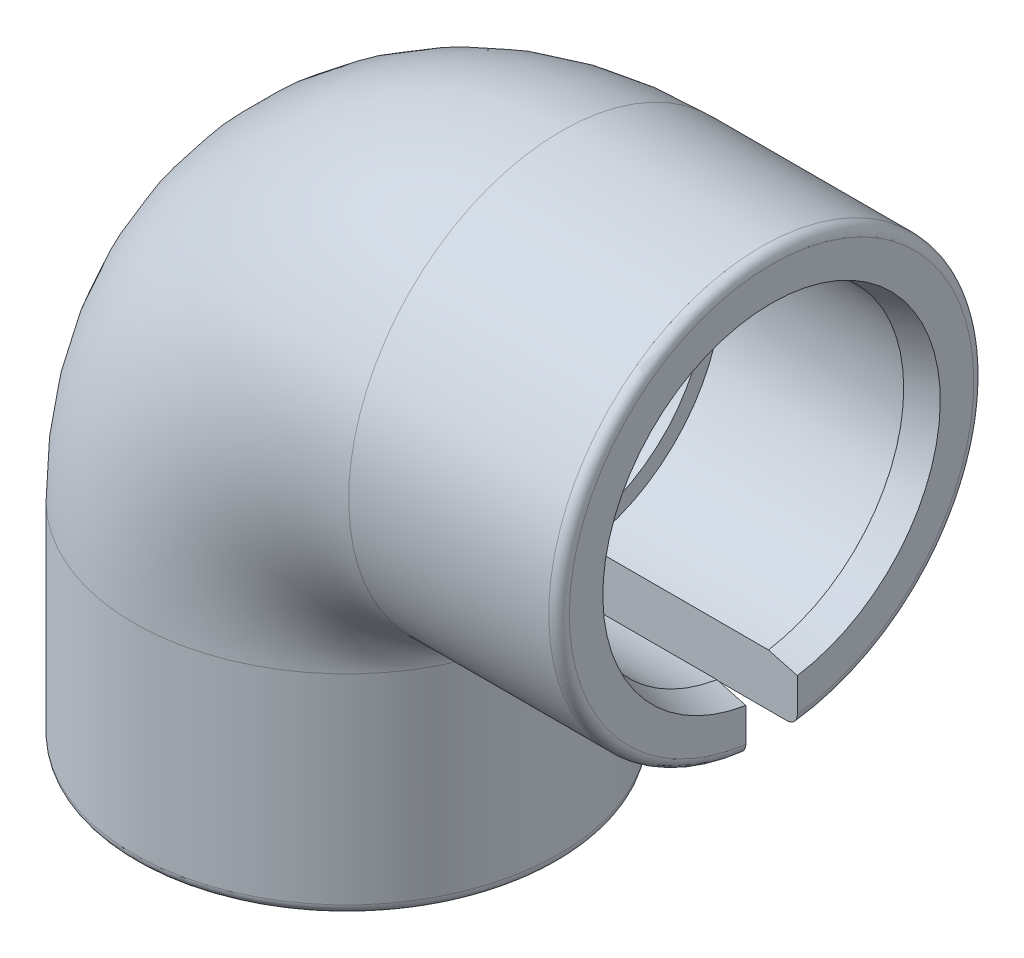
ISO-10303-21;
HEADER;
FILE_DESCRIPTION(('STEP AP214'),'2;1');
FILE_NAME('part.step','',(''),(''),'','','');
FILE_SCHEMA(('AUTOMOTIVE_DESIGN { 1 0 10303 214 1 1 1 1 }'));
ENDSEC;
DATA;
#1=APPLICATION_CONTEXT('core data for automotive mechanical design processes');
#2=APPLICATION_PROTOCOL_DEFINITION('international standard','automotive_design',2000,#1);
#3=PRODUCT_CONTEXT('',#1,'mechanical');
#4=PRODUCT('Part','Part','',(#3));
#5=PRODUCT_RELATED_PRODUCT_CATEGORY('part','',(#4));
#6=PRODUCT_DEFINITION_FORMATION('','',#4);
#7=PRODUCT_DEFINITION_CONTEXT('part definition',#1,'design');
#8=PRODUCT_DEFINITION('design','',#6,#7);
#9=PRODUCT_DEFINITION_SHAPE('','',#8);
#10=(LENGTH_UNIT() NAMED_UNIT(*) SI_UNIT(.MILLI.,.METRE.));
#11=(NAMED_UNIT(*) PLANE_ANGLE_UNIT() SI_UNIT($,.RADIAN.));
#12=(NAMED_UNIT(*) SI_UNIT($,.STERADIAN.) SOLID_ANGLE_UNIT());
#13=UNCERTAINTY_MEASURE_WITH_UNIT(LENGTH_MEASURE(1.E-05),#10,'distance_accuracy_value','');
#14=(GEOMETRIC_REPRESENTATION_CONTEXT(3) GLOBAL_UNCERTAINTY_ASSIGNED_CONTEXT((#13)) GLOBAL_UNIT_ASSIGNED_CONTEXT((#10,
#11,#12)) REPRESENTATION_CONTEXT('',''));
#15=CARTESIAN_POINT('',(0.,0.,0.));
#16=DIRECTION('',(0.,0.,1.));
#17=DIRECTION('',(1.,0.,0.));
#18=AXIS2_PLACEMENT_3D('',#15,#16,#17);
#19=CARTESIAN_POINT('',(16.335,16.665,0.));
#20=DIRECTION('',(-1.,0.,0.));
#21=DIRECTION('',(0.,0.,1.));
#22=AXIS2_PLACEMENT_3D('',#19,#20,#21);
#23=PLANE('',#22);
#24=DIRECTION('',(0.,-1.,0.));
#25=VECTOR('',#24,1.);
#26=CARTESIAN_POINT('',(16.335,33.166,-2.));
#27=LINE('',#26,#25);
#28=CARTESIAN_POINT('',(16.335,3.71857192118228,-2.));
#29=VERTEX_POINT('',#28);
#30=CARTESIAN_POINT('',(16.335,1.09290958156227,-2.));
#31=VERTEX_POINT('',#30);
#32=EDGE_CURVE('E281',#29,#31,#27,.T.);
#33=ORIENTED_EDGE('',*,*,#32,.T.);
#34=CARTESIAN_POINT('',(16.335,16.665,0.));
#35=DIRECTION('',(-1.,0.,0.));
#36=DIRECTION('',(0.,0.,1.));
#37=AXIS2_PLACEMENT_3D('',#34,#35,#36);
#38=CIRCLE('',#37,15.7);
#39=CARTESIAN_POINT('',(16.335,1.09290958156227,2.));
#40=VERTEX_POINT('',#39);
#41=EDGE_CURVE('E224',#31,#40,#38,.F.);
#42=ORIENTED_EDGE('',*,*,#41,.T.);
#43=DIRECTION('',(0.,1.,0.));
#44=VECTOR('',#43,1.);
#45=CARTESIAN_POINT('',(16.335,33.166,2.));
#46=LINE('',#45,#44);
#47=CARTESIAN_POINT('',(16.335,3.71857192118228,2.));
#48=VERTEX_POINT('',#47);
#49=EDGE_CURVE('E60',#40,#48,#46,.T.);
#50=ORIENTED_EDGE('',*,*,#49,.T.);
#51=CARTESIAN_POINT('',(16.335,16.665,0.));
#52=DIRECTION('',(-1.,0.,0.));
#53=DIRECTION('',(0.,0.,1.));
#54=AXIS2_PLACEMENT_3D('',#51,#52,#53);
#55=CIRCLE('',#54,13.1);
#56=EDGE_CURVE('E221',#48,#29,#55,.T.);
#57=ORIENTED_EDGE('',*,*,#56,.T.);
#58=EDGE_LOOP('',(#33,#42,#50,#57));
#59=FACE_BOUND('',#58,.T.);
#60=ADVANCED_FACE('F45',(#59),#23,.F.);
#61=CARTESIAN_POINT('',(0.,0.,0.));
#62=DIRECTION('',(0.,0.,-1.));
#63=DIRECTION('',(0.,-1.,0.));
#64=AXIS2_PLACEMENT_3D('',#61,#62,#63);
#65=TOROIDAL_SURFACE('',#64,16.665,16.5);
#66=CARTESIAN_POINT('',(0.,16.665,0.));
#67=DIRECTION('',(1.,0.,0.));
#68=DIRECTION('',(0.,-1.,0.));
#69=AXIS2_PLACEMENT_3D('',#66,#67,#68);
#70=CIRCLE('',#69,16.5);
#71=CARTESIAN_POINT('',(0.,0.286660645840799,-2.));
#72=VERTEX_POINT('',#71);
#73=CARTESIAN_POINT('',(0.,0.286660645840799,2.));
#74=VERTEX_POINT('',#73);
#75=EDGE_CURVE('E149',#72,#74,#70,.T.);
#76=ORIENTED_EDGE('',*,*,#75,.F.);
#77=CARTESIAN_POINT('',(0.,0.,-2.));
#78=DIRECTION('',(0.,0.,-1.));
#79=DIRECTION('',(-1.,0.,0.));
#80=AXIS2_PLACEMENT_3D('',#77,#78,#79);
#81=CIRCLE('',#80,0.286660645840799);
#82=CARTESIAN_POINT('',(-0.286660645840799,0.,-2.));
#83=VERTEX_POINT('',#82);
#84=EDGE_CURVE('E139',#83,#72,#81,.T.);
#85=ORIENTED_EDGE('',*,*,#84,.F.);
#86=CARTESIAN_POINT('',(-16.665,0.,0.));
#87=DIRECTION('',(0.,-1.,0.));
#88=DIRECTION('',(1.,0.,0.));
#89=AXIS2_PLACEMENT_3D('',#86,#87,#88);
#90=CIRCLE('',#89,16.5);
#91=CARTESIAN_POINT('',(-0.286660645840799,0.,2.));
#92=VERTEX_POINT('',#91);
#93=EDGE_CURVE('E147',#92,#83,#90,.T.);
#94=ORIENTED_EDGE('',*,*,#93,.F.);
#95=CARTESIAN_POINT('',(0.,0.,2.));
#96=DIRECTION('',(0.,0.,1.));
#97=DIRECTION('',(1.,0.,0.));
#98=AXIS2_PLACEMENT_3D('',#95,#96,#97);
#99=CIRCLE('',#98,0.286660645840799);
#100=EDGE_CURVE('E67',#74,#92,#99,.T.);
#101=ORIENTED_EDGE('',*,*,#100,.F.);
#102=EDGE_LOOP('',(#76,#85,#94,#101));
#103=FACE_BOUND('',#102,.T.);
#104=ADVANCED_FACE('F146',(#103),#65,.T.);
#105=CARTESIAN_POINT('',(19.,16.665,0.));
#106=DIRECTION('',(-1.,0.,0.));
#107=DIRECTION('',(0.,-1.,0.));
#108=AXIS2_PLACEMENT_3D('',#105,#106,#107);
#109=CYLINDRICAL_SURFACE('',#108,16.5);
#110=CARTESIAN_POINT('',(15.535,16.665,0.));
#111=DIRECTION('',(-1.,0.,0.));
#112=DIRECTION('',(0.,0.,1.));
#113=AXIS2_PLACEMENT_3D('',#110,#111,#112);
#114=CIRCLE('',#113,16.5);
#115=CARTESIAN_POINT('',(15.535,0.286660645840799,2.));
#116=VERTEX_POINT('',#115);
#117=CARTESIAN_POINT('',(15.535,0.286660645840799,-2.));
#118=VERTEX_POINT('',#117);
#119=EDGE_CURVE('E227',#116,#118,#114,.T.);
#120=ORIENTED_EDGE('',*,*,#119,.T.);
#121=DIRECTION('',(-1.,0.,0.));
#122=VECTOR('',#121,1.);
#123=CARTESIAN_POINT('',(19.,0.286660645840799,-2.));
#124=LINE('',#123,#122);
#125=EDGE_CURVE('E284',#72,#118,#124,.F.);
#126=ORIENTED_EDGE('',*,*,#125,.F.);
#127=ORIENTED_EDGE('',*,*,#75,.T.);
#128=DIRECTION('',(-1.,0.,0.));
#129=VECTOR('',#128,1.);
#130=CARTESIAN_POINT('',(19.,0.286660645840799,2.));
#131=LINE('',#130,#129);
#132=EDGE_CURVE('E342',#116,#74,#131,.T.);
#133=ORIENTED_EDGE('',*,*,#132,.F.);
#134=EDGE_LOOP('',(#120,#126,#127,#133));
#135=FACE_BOUND('',#134,.T.);
#136=ADVANCED_FACE('F253',(#135),#109,.T.);
#137=CARTESIAN_POINT('',(19.,16.665,0.));
#138=DIRECTION('',(-1.,0.,0.));
#139=DIRECTION('',(0.,-1.,0.));
#140=AXIS2_PLACEMENT_3D('',#137,#138,#139);
#141=CYLINDRICAL_SURFACE('',#140,12.5);
#142=DIRECTION('',(-1.,0.,0.));
#143=VECTOR('',#142,1.);
#144=CARTESIAN_POINT('',(19.,4.32603732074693,-2.));
#145=LINE('',#144,#143);
#146=CARTESIAN_POINT('',(0.,4.32603732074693,-2.));
#147=VERTEX_POINT('',#146);
#148=CARTESIAN_POINT('',(14.0957695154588,4.32603732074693,-2.));
#149=VERTEX_POINT('',#148);
#150=EDGE_CURVE('E286',#147,#149,#145,.F.);
#151=ORIENTED_EDGE('',*,*,#150,.T.);
#152=CARTESIAN_POINT('',(14.0957695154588,16.665,0.));
#153=DIRECTION('',(-1.,0.,0.));
#154=DIRECTION('',(0.,0.,1.));
#155=AXIS2_PLACEMENT_3D('',#152,#153,#154);
#156=CIRCLE('',#155,12.5);
#157=CARTESIAN_POINT('',(14.0957695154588,4.32603732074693,2.));
#158=VERTEX_POINT('',#157);
#159=EDGE_CURVE('E218',#149,#158,#156,.F.);
#160=ORIENTED_EDGE('',*,*,#159,.T.);
#161=DIRECTION('',(-1.,0.,0.));
#162=VECTOR('',#161,1.);
#163=CARTESIAN_POINT('',(19.,4.32603732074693,2.));
#164=LINE('',#163,#162);
#165=CARTESIAN_POINT('',(0.,4.32603732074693,2.));
#166=VERTEX_POINT('',#165);
#167=EDGE_CURVE('E339',#158,#166,#164,.T.);
#168=ORIENTED_EDGE('',*,*,#167,.T.);
#169=CARTESIAN_POINT('',(0.,16.665,0.));
#170=DIRECTION('',(1.,0.,0.));
#171=DIRECTION('',(0.,-1.,0.));
#172=AXIS2_PLACEMENT_3D('',#169,#170,#171);
#173=CIRCLE('',#172,12.5);
#174=EDGE_CURVE('E153',#147,#166,#173,.T.);
#175=ORIENTED_EDGE('',*,*,#174,.F.);
#176=EDGE_LOOP('',(#151,#160,#168,#175));
#177=FACE_BOUND('',#176,.T.);
#178=ADVANCED_FACE('F258',(#177),#141,.F.);
#179=CARTESIAN_POINT('',(0.,16.665,0.));
#180=DIRECTION('',(-1.,0.,0.));
#181=DIRECTION('',(0.,0.,1.));
#182=AXIS2_PLACEMENT_3D('',#179,#180,#181);
#183=PLANE('',#182);
#184=DIRECTION('',(0.,-1.,0.));
#185=VECTOR('',#184,1.);
#186=CARTESIAN_POINT('',(0.,33.166,-2.));
#187=LINE('',#186,#185);
#188=CARTESIAN_POINT('',(0.,5.59420508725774,-2.));
#189=VERTEX_POINT('',#188);
#190=EDGE_CURVE('E291',#189,#147,#187,.T.);
#191=ORIENTED_EDGE('',*,*,#190,.T.);
#192=ORIENTED_EDGE('',*,*,#174,.T.);
#193=DIRECTION('',(0.,1.,0.));
#194=VECTOR('',#193,1.);
#195=CARTESIAN_POINT('',(0.,33.166,2.));
#196=LINE('',#195,#194);
#197=CARTESIAN_POINT('',(0.,5.59420508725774,2.));
#198=VERTEX_POINT('',#197);
#199=EDGE_CURVE('E336',#166,#198,#196,.T.);
#200=ORIENTED_EDGE('',*,*,#199,.T.);
#201=CARTESIAN_POINT('',(0.,16.665,0.));
#202=DIRECTION('',(-1.,0.,0.));
#203=DIRECTION('',(0.,0.,1.));
#204=AXIS2_PLACEMENT_3D('',#201,#202,#203);
#205=CIRCLE('',#204,11.25);
#206=EDGE_CURVE('E358',#189,#198,#205,.F.);
#207=ORIENTED_EDGE('',*,*,#206,.F.);
#208=EDGE_LOOP('',(#191,#192,#200,#207));
#209=FACE_BOUND('',#208,.T.);
#210=ADVANCED_FACE('F357',(#209),#183,.F.);
#211=CARTESIAN_POINT('',(0.,0.,0.));
#212=DIRECTION('',(0.,0.,-1.));
#213=DIRECTION('',(0.,-1.,0.));
#214=AXIS2_PLACEMENT_3D('',#211,#212,#213);
#215=TOROIDAL_SURFACE('',#214,16.665,11.25);
#216=CARTESIAN_POINT('',(-16.665,0.,0.));
#217=DIRECTION('',(0.,1.,0.));
#218=DIRECTION('',(1.,0.,0.));
#219=AXIS2_PLACEMENT_3D('',#216,#217,#218);
#220=CIRCLE('',#219,11.25);
#221=CARTESIAN_POINT('',(-5.415,0.,0.));
#222=VERTEX_POINT('',#221);
#223=EDGE_CURVE('E163',#222,#222,#220,.F.);
#224=ORIENTED_EDGE('',*,*,#223,.T.);
#225=EDGE_LOOP('',(#224));
#226=FACE_BOUND('',#225,.T.);
#227=CARTESIAN_POINT('',(0.,0.,-2.));
#228=DIRECTION('',(0.,0.,-1.));
#229=DIRECTION('',(-1.,0.,0.));
#230=AXIS2_PLACEMENT_3D('',#227,#228,#229);
#231=CIRCLE('',#230,5.59420508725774);
#232=CARTESIAN_POINT('',(-3.34482794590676,4.48411156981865,-2.));
#233=VERTEX_POINT('',#232);
#234=EDGE_CURVE('E294',#233,#189,#231,.T.);
#235=ORIENTED_EDGE('',*,*,#234,.T.);
#236=ORIENTED_EDGE('',*,*,#206,.T.);
#237=CARTESIAN_POINT('',(0.,0.,2.));
#238=DIRECTION('',(0.,0.,1.));
#239=DIRECTION('',(1.,0.,0.));
#240=AXIS2_PLACEMENT_3D('',#237,#238,#239);
#241=CIRCLE('',#240,5.59420508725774);
#242=CARTESIAN_POINT('',(-3.34482794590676,4.48411156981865,1.99999999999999));
#243=VERTEX_POINT('',#242);
#244=EDGE_CURVE('E332',#198,#243,#241,.T.);
#245=ORIENTED_EDGE('',*,*,#244,.T.);
#246=CARTESIAN_POINT('',(-3.34482794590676,4.25844467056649,0.));
#247=CARTESIAN_POINT('',(-3.34482794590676,4.25844309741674,-0.228981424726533));
#248=CARTESIAN_POINT('',(-3.34482794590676,4.26735397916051,-0.457953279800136));
#249=CARTESIAN_POINT('',(-3.34482794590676,4.30274988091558,-0.914517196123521));
#250=CARTESIAN_POINT('',(-3.34482794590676,4.32923394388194,-1.14210933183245));
#251=CARTESIAN_POINT('',(-3.34482794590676,4.3991339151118,-1.59485143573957));
#252=CARTESIAN_POINT('',(-3.34482794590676,4.44256357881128,-1.81999926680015));
#253=CARTESIAN_POINT('',(-3.34482794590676,4.54540839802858,-2.26668952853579));
#254=CARTESIAN_POINT('',(-3.34482794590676,4.60483029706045,-2.48823039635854));
#255=CARTESIAN_POINT('',(-3.34482794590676,4.74737178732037,-2.95564994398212));
#256=CARTESIAN_POINT('',(-3.34482794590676,4.83258179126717,-3.200890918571));
#257=CARTESIAN_POINT('',(-3.34482794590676,5.02047185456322,-3.68449446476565));
#258=CARTESIAN_POINT('',(-3.34482794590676,5.12314854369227,-3.92285835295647));
#259=CARTESIAN_POINT('',(-3.34482794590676,5.34464466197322,-4.39215075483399));
#260=CARTESIAN_POINT('',(-3.34482794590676,5.46347536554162,-4.62307393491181));
#261=CARTESIAN_POINT('',(-3.34482794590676,5.71600669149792,-5.07663216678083));
#262=CARTESIAN_POINT('',(-3.34482794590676,5.84970819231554,-5.29926672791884));
#263=CARTESIAN_POINT('',(-3.34482794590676,6.1609703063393,-5.78217634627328));
#264=CARTESIAN_POINT('',(-3.34482794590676,6.3418025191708,-6.04034856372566));
#265=CARTESIAN_POINT('',(-3.34482794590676,6.72237482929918,-6.54250359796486));
#266=CARTESIAN_POINT('',(-3.34482794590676,6.9221231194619,-6.78648019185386));
#267=CARTESIAN_POINT('',(-3.34482794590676,7.33917806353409,-7.25901231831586));
#268=CARTESIAN_POINT('',(-3.34482794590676,7.55648777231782,-7.48756515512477));
#269=CARTESIAN_POINT('',(-3.34482794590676,8.00739734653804,-7.92799799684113));
#270=CARTESIAN_POINT('',(-3.34482794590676,8.24099786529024,-8.13987733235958));
#271=CARTESIAN_POINT('',(-3.34482794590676,8.75448220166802,-8.5720039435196));
#272=CARTESIAN_POINT('',(-3.34482794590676,9.03644450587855,-8.78978926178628));
#273=CARTESIAN_POINT('',(-3.34482794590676,9.61777454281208,-9.20079253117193));
#274=CARTESIAN_POINT('',(-3.34482794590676,9.91714382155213,-9.39400829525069));
#275=CARTESIAN_POINT('',(-3.34482794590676,10.5313194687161,-9.75419097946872));
#276=CARTESIAN_POINT('',(-3.34482794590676,10.8461269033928,-9.92115608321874));
#277=CARTESIAN_POINT('',(-3.34482794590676,11.4889927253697,-10.227250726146));
#278=CARTESIAN_POINT('',(-3.34482794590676,11.8170505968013,-10.3663813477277));
#279=CARTESIAN_POINT('',(-3.34482794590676,12.4799494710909,-10.6138733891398));
#280=CARTESIAN_POINT('',(-3.34482794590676,12.8146559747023,-10.7225948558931));
#281=CARTESIAN_POINT('',(-3.34482794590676,13.4922997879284,-10.9103854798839));
#282=CARTESIAN_POINT('',(-3.34482794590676,13.8352371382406,-10.9894544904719));
#283=CARTESIAN_POINT('',(-3.34482794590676,14.5267055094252,-11.1170056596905));
#284=CARTESIAN_POINT('',(-3.34482794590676,14.8752356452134,-11.1654926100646));
#285=CARTESIAN_POINT('',(-3.34482794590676,15.5752291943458,-11.2312259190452));
#286=CARTESIAN_POINT('',(-3.34482794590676,15.926692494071,-11.2484734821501));
#287=CARTESIAN_POINT('',(-3.34482794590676,16.614458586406,-11.2512705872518));
#288=CARTESIAN_POINT('',(-3.34482794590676,16.9507563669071,-11.238165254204));
#289=CARTESIAN_POINT('',(-3.34482794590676,17.6209575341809,-11.1829037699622));
#290=CARTESIAN_POINT('',(-3.34482794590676,17.9548609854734,-11.1407484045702));
#291=CARTESIAN_POINT('',(-3.34482794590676,18.6176847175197,-11.0275320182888));
#292=CARTESIAN_POINT('',(-3.34482794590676,18.9466057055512,-10.9564751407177));
#293=CARTESIAN_POINT('',(-3.34482794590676,19.5969663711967,-10.785839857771));
#294=CARTESIAN_POINT('',(-3.34482794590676,19.918406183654,-10.6862619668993));
#295=CARTESIAN_POINT('',(-3.34482794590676,20.5414485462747,-10.4627470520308));
#296=CARTESIAN_POINT('',(-3.34482794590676,20.8433571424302,-10.3396624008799));
#297=CARTESIAN_POINT('',(-3.34482794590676,21.4355318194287,-10.0681069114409));
#298=CARTESIAN_POINT('',(-3.34482794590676,21.7257981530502,-9.91963662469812));
#299=CARTESIAN_POINT('',(-3.34482794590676,22.2924837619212,-9.59832651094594));
#300=CARTESIAN_POINT('',(-3.34482794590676,22.5689041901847,-9.42548871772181));
#301=CARTESIAN_POINT('',(-3.34482794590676,23.1058281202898,-9.05664055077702));
#302=CARTESIAN_POINT('',(-3.34482794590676,23.3663317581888,-8.86063037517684));
#303=CARTESIAN_POINT('',(-3.34482794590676,23.8648201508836,-8.4506336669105));
#304=CARTESIAN_POINT('',(-3.34482794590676,24.1031300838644,-8.23704236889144));
#305=CARTESIAN_POINT('',(-3.34482794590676,24.56073131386,-7.7903766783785));
#306=CARTESIAN_POINT('',(-3.34482794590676,24.7800228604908,-7.5573025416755));
#307=CARTESIAN_POINT('',(-3.34482794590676,25.1979487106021,-7.07333484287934));
#308=CARTESIAN_POINT('',(-3.34482794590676,25.3965839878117,-6.82244212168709));
#309=CARTESIAN_POINT('',(-3.34482794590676,25.7717267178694,-6.30462468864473));
#310=CARTESIAN_POINT('',(-3.34482794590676,25.9482342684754,-6.03770004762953));
#311=CARTESIAN_POINT('',(-3.34482794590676,26.2760846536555,-5.49259927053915));
#312=CARTESIAN_POINT('',(-3.34482794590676,26.4276701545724,-5.21456905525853));
#313=CARTESIAN_POINT('',(-3.34482794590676,26.7067627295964,-4.64667592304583));
#314=CARTESIAN_POINT('',(-3.34482794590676,26.8342699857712,-4.35681309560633));
#315=CARTESIAN_POINT('',(-3.34482794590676,27.0642640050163,-3.76733406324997));
#316=CARTESIAN_POINT('',(-3.34482794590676,27.1667514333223,-3.46771811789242));
#317=CARTESIAN_POINT('',(-3.34482794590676,27.3459536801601,-2.86087510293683));
#318=CARTESIAN_POINT('',(-3.34482794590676,27.4226685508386,-2.55364804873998));
#319=CARTESIAN_POINT('',(-3.34482794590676,27.5494128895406,-1.93548118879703));
#320=CARTESIAN_POINT('',(-3.34482794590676,27.5995852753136,-1.62457067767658));
#321=CARTESIAN_POINT('',(-3.34482794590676,27.673509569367,-0.99962503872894));
#322=CARTESIAN_POINT('',(-3.34482794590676,27.6972615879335,-0.685589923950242));
#323=CARTESIAN_POINT('',(-3.34482794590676,27.7181713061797,-0.0566398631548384));
#324=CARTESIAN_POINT('',(-3.34482794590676,27.715329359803,0.258275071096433));
#325=CARTESIAN_POINT('',(-3.34482794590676,27.6830728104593,0.886741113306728));
#326=CARTESIAN_POINT('',(-3.34482794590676,27.6536582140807,1.20029222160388));
#327=CARTESIAN_POINT('',(-3.34482794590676,27.5685541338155,1.82319054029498));
#328=CARTESIAN_POINT('',(-3.34482794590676,27.5129154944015,2.13254469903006));
#329=CARTESIAN_POINT('',(-3.34482794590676,27.3757884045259,2.74546891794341));
#330=CARTESIAN_POINT('',(-3.34482794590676,27.2943000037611,3.04903898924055));
#331=CARTESIAN_POINT('',(-3.34482794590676,27.1060670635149,3.64824336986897));
#332=CARTESIAN_POINT('',(-3.34482794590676,26.9993226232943,3.94387771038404));
#333=CARTESIAN_POINT('',(-3.34482794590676,26.7613534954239,4.52512355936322));
#334=CARTESIAN_POINT('',(-3.34482794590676,26.6301287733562,4.81073505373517));
#335=CARTESIAN_POINT('',(-3.34482794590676,26.3439969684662,5.37022694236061));
#336=CARTESIAN_POINT('',(-3.34482794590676,26.1890644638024,5.64409433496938));
#337=CARTESIAN_POINT('',(-3.34482794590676,25.8567452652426,6.17784759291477));
#338=CARTESIAN_POINT('',(-3.34482794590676,25.6793585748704,6.43773346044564));
#339=CARTESIAN_POINT('',(-3.34482794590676,25.3034137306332,6.94171274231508));
#340=CARTESIAN_POINT('',(-3.34482794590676,25.1048554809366,7.18580608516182));
#341=CARTESIAN_POINT('',(-3.34482794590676,24.6879999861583,7.65651101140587));
#342=CARTESIAN_POINT('',(-3.34482794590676,24.4697026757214,7.88312253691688));
#343=CARTESIAN_POINT('',(-3.34482794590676,24.013952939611,8.31825139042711));
#344=CARTESIAN_POINT('',(-3.34482794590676,23.7764217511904,8.52668622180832));
#345=CARTESIAN_POINT('',(-3.34482794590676,23.2847438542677,8.92293605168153));
#346=CARTESIAN_POINT('',(-3.34482794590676,23.0305971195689,9.11075101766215));
#347=CARTESIAN_POINT('',(-3.34482794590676,22.507506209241,9.46450557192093));
#348=CARTESIAN_POINT('',(-3.34482794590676,22.238561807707,9.63044482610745));
#349=CARTESIAN_POINT('',(-3.34482794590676,21.6877940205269,9.93935852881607));
#350=CARTESIAN_POINT('',(-3.34482794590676,21.4059705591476,10.0823328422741));
#351=CARTESIAN_POINT('',(-3.34482794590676,20.8289621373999,10.3455374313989));
#352=CARTESIAN_POINT('',(-3.34482794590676,20.5336830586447,10.4655613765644));
#353=CARTESIAN_POINT('',(-3.34482794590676,19.9341526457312,10.6805844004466));
#354=CARTESIAN_POINT('',(-3.34482794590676,19.6299012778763,10.7755833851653));
#355=CARTESIAN_POINT('',(-3.34482794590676,19.014564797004,10.9400154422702));
#356=CARTESIAN_POINT('',(-3.34482794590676,18.7034795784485,11.00944811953));
#357=CARTESIAN_POINT('',(-3.34482794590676,18.0766423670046,11.122403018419));
#358=CARTESIAN_POINT('',(-3.34482794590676,17.7608903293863,11.1659249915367));
#359=CARTESIAN_POINT('',(-3.34482794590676,17.1221298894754,11.227370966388));
#360=CARTESIAN_POINT('',(-3.34482794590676,16.7990836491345,11.2449016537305));
#361=CARTESIAN_POINT('',(-3.34482794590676,16.1526525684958,11.2531784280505));
#362=CARTESIAN_POINT('',(-3.34482794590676,15.8292677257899,11.2439243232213));
#363=CARTESIAN_POINT('',(-3.34482794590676,15.1843212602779,11.1988912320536));
#364=CARTESIAN_POINT('',(-3.34482794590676,14.8627598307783,11.1631094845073));
#365=CARTESIAN_POINT('',(-3.34482794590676,14.2236227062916,11.0654766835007));
#366=CARTESIAN_POINT('',(-3.34482794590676,13.9060470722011,11.0036252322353));
#367=CARTESIAN_POINT('',(-3.34482794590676,13.2690353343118,10.8526237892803));
#368=CARTESIAN_POINT('',(-3.34482794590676,12.9497522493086,10.762828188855));
#369=CARTESIAN_POINT('',(-3.34482794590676,12.3196166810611,10.5573957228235));
#370=CARTESIAN_POINT('',(-3.34482794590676,12.0087643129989,10.4417585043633));
#371=CARTESIAN_POINT('',(-3.34482794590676,11.3975424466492,10.1857250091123));
#372=CARTESIAN_POINT('',(-3.34482794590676,11.097169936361,10.0453359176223));
#373=CARTESIAN_POINT('',(-3.34482794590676,10.508535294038,9.74090959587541));
#374=CARTESIAN_POINT('',(-3.34482794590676,10.2202774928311,9.57686400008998));
#375=CARTESIAN_POINT('',(-3.34482794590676,9.64704708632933,9.21984125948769));
#376=CARTESIAN_POINT('',(-3.34482794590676,9.36260870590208,9.02600610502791));
#377=CARTESIAN_POINT('',(-3.34482794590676,8.81032477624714,8.61574841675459));
#378=CARTESIAN_POINT('',(-3.34482794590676,8.54248699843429,8.39931542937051));
#379=CARTESIAN_POINT('',(-3.34482794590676,8.02489838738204,7.94527657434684));
#380=CARTESIAN_POINT('',(-3.34482794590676,7.77516717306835,7.7076483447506));
#381=CARTESIAN_POINT('',(-3.34482794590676,7.29569953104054,7.21300911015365));
#382=CARTESIAN_POINT('',(-3.34482794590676,7.06596329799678,6.95599791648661));
#383=CARTESIAN_POINT('',(-3.34482794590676,6.61932152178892,6.41344088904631));
#384=CARTESIAN_POINT('',(-3.34482794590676,6.40330356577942,6.12716316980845));
#385=CARTESIAN_POINT('',(-3.34482794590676,5.99674850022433,5.53694800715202));
#386=CARTESIAN_POINT('',(-3.34482794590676,5.80621579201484,5.23300752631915));
#387=CARTESIAN_POINT('',(-3.34482794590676,5.45351000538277,4.60965710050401));
#388=CARTESIAN_POINT('',(-3.34482794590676,5.29129467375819,4.29027112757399));
#389=CARTESIAN_POINT('',(-3.34482794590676,4.99816646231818,3.63748270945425));
#390=CARTESIAN_POINT('',(-3.34482794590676,4.86723911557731,3.30408682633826));
#391=CARTESIAN_POINT('',(-3.34482794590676,4.67411606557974,2.72595298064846));
#392=CARTESIAN_POINT('',(-3.34482794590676,4.60304512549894,2.48415823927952));
#393=CARTESIAN_POINT('',(-3.34482794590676,4.47982309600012,1.99581467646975));
#394=CARTESIAN_POINT('',(-3.34482794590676,4.42766704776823,1.74926711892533));
#395=CARTESIAN_POINT('',(-3.34482794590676,4.34367309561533,1.25316373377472));
#396=CARTESIAN_POINT('',(-3.34482794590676,4.3117995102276,1.00361398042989));
#397=CARTESIAN_POINT('',(-3.34482794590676,4.26918664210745,0.502705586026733));
#398=CARTESIAN_POINT('',(-3.34482794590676,4.25844639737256,0.251347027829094));
#399=CARTESIAN_POINT('',(-3.34482794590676,4.25844467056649,0.));
#400=B_SPLINE_CURVE_WITH_KNOTS('',3,(#246,#247,#248,#249,#250,#251,#252,#253,#254,#255,#256,
#257,#258,#259,#260,#261,#262,#263,#264,#265,#266,#267,#268,#269,#270,#271,#272,#273,#274,#275,
#276,#277,#278,#279,#280,#281,#282,#283,#284,#285,#286,#287,#288,#289,#290,#291,#292,#293,#294,
#295,#296,#297,#298,#299,#300,#301,#302,#303,#304,#305,#306,#307,#308,#309,#310,#311,#312,#313,
#314,#315,#316,#317,#318,#319,#320,#321,#322,#323,#324,#325,#326,#327,#328,#329,#330,#331,#332,
#333,#334,#335,#336,#337,#338,#339,#340,#341,#342,#343,#344,#345,#346,#347,#348,#349,#350,#351,
#352,#353,#354,#355,#356,#357,#358,#359,#360,#361,#362,#363,#364,#365,#366,#367,#368,#369,#370,
#371,#372,#373,#374,#375,#376,#377,#378,#379,#380,#381,#382,#383,#384,#385,#386,#387,#388,#389,
#390,#391,#392,#393,#394,#395,#396,#397,#398,#399),.UNSPECIFIED.,.T.,.F.,(4,2,2,2,2,2,2,2,2,2,2,
2,2,2,2,2,2,2,2,2,2,2,2,2,2,2,2,2,2,2,2,2,2,2,2,2,2,2,2,2,2,2,2,2,2,2,2,2,2,2,2,2,2,2,2,2,2,2,2,
2,2,2,2,2,2,2,2,2,2,2,2,2,2,2,2,2,4),(0.,0.686757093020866,1.37347678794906,2.06075508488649,
2.7483236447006,3.52645292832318,4.30443224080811,5.08295734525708,5.86152846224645,
6.80620107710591,7.75128473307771,8.6965331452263,9.64181948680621,10.7093645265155,
11.7770045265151,12.8447183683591,13.9123906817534,14.9668277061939,16.0212699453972,
17.0755469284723,18.1297832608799,19.1381987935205,20.1465870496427,21.154830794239,
22.1630563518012,23.1399758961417,24.1168742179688,25.0936910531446,26.0704995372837,
27.0294081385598,27.9883041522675,28.9471549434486,29.9060014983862,30.8548740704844,
31.8037394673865,32.7525796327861,33.7014178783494,34.6450937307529,35.5887656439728,
36.5324249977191,37.4760841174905,38.4179211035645,39.3597562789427,40.3015877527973,
41.2434205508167,42.1862704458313,43.1291201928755,44.0719742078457,45.0148313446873,
45.9617663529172,46.9087028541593,47.8556538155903,48.8026103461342,49.7577166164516,
50.7128264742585,51.6679510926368,52.6230848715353,53.5925297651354,54.5619816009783,
55.5315343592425,56.5011019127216,57.4949808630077,58.488873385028,59.4824778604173,
60.4764345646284,61.5078902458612,62.5398252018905,63.5728620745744,64.6059090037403,
65.6805019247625,66.7552801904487,67.8284407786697,68.9011041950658,69.6565045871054,
70.4117067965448,71.1655767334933,71.9194123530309),.UNSPECIFIED.);
#401=EDGE_CURVE('E327',#243,#233,#400,.T.);
#402=ORIENTED_EDGE('',*,*,#401,.T.);
#403=EDGE_LOOP('',(#235,#236,#245,#402));
#404=FACE_BOUND('',#403,.T.);
#405=ADVANCED_FACE('F266',(#226,#404),#215,.F.);
#406=CARTESIAN_POINT('',(14.0957695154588,16.665,0.));
#407=DIRECTION('',(1.,0.,0.));
#408=DIRECTION('',(0.,0.,-1.));
#409=AXIS2_PLACEMENT_3D('',#406,#407,#408);
#410=CONICAL_SURFACE('',#409,12.5,0.261799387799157);
#411=ORIENTED_EDGE('',*,*,#159,.F.);
#412=CARTESIAN_POINT('',(33.8352304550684,-1.0113871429,-2.));
#413=CARTESIAN_POINT('',(32.2235288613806,-0.576770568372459,-2.));
#414=CARTESIAN_POINT('',(30.6118748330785,-0.141977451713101,-2.));
#415=CARTESIAN_POINT('',(27.3886958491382,0.728087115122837,-2.));
#416=CARTESIAN_POINT('',(25.7771708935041,1.16335856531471,-2.));
#417=CARTESIAN_POINT('',(22.5542886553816,2.03450378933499,-2.));
#418=CARTESIAN_POINT('',(20.9429313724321,2.47037756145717,-2.));
#419=CARTESIAN_POINT('',(17.7204311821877,3.34291840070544,-2.));
#420=CARTESIAN_POINT('',(16.1092882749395,3.77958546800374,-2.));
#421=CARTESIAN_POINT('',(12.8872871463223,4.65398963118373,-2.));
#422=CARTESIAN_POINT('',(11.2764289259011,5.09172673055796,-2.));
#423=CARTESIAN_POINT('',(8.05511687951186,5.96868396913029,-2.));
#424=CARTESIAN_POINT('',(6.44466305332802,6.40790410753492,-2.));
#425=CARTESIAN_POINT('',(4.02942482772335,7.06836267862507,-2.));
#426=CARTESIAN_POINT('',(3.22441790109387,7.28878727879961,-2.));
#427=CARTESIAN_POINT('',(1.61458932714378,7.73031154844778,-2.));
#428=CARTESIAN_POINT('',(0.809767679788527,7.95141121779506,-2.));
#429=CARTESIAN_POINT('',(-0.79964671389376,8.39444815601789,-2.));
#430=CARTESIAN_POINT('',(-1.60423945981,8.61638542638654,-2.));
#431=CARTESIAN_POINT('',(-3.21312438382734,9.06134855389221,-2.));
#432=CARTESIAN_POINT('',(-4.01741656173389,9.28437441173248,-2.));
#433=CARTESIAN_POINT('',(-4.82152282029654,9.50807010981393,-2.));
#434=B_SPLINE_CURVE_WITH_KNOTS('',3,(#412,#413,#414,#415,#416,#417,#418,#419,#420,#421,#422,
#423,#424,#425,#426,#427,#428,#429,#430,#431,#432,#433),.UNSPECIFIED.,.F.,.F.,(4,2,2,2,2,2,2,2,
2,2,4),(0.,5.00782016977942,10.0156404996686,15.0234466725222,20.0312539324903,25.0390775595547,
30.0468985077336,32.5508168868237,35.0547347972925,37.5586571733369,40.062581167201),.UNSPECIFIED.);
#435=EDGE_CURVE('E283',#29,#149,#434,.T.);
#436=ORIENTED_EDGE('',*,*,#435,.F.);
#437=ORIENTED_EDGE('',*,*,#56,.F.);
#438=CARTESIAN_POINT('',(-4.82152282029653,9.50807010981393,2.));
#439=CARTESIAN_POINT('',(-3.87363261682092,9.24438655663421,2.));
#440=CARTESIAN_POINT('',(-2.92548841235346,8.98161872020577,2.));
#441=CARTESIAN_POINT('',(-1.02880019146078,8.45753270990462,2.));
#442=CARTESIAN_POINT('',(-0.0802561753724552,8.19621453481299,2.));
#443=CARTESIAN_POINT('',(1.81712294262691,7.67464621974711,2.));
#444=CARTESIAN_POINT('',(2.76595804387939,7.4143960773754,2.));
#445=CARTESIAN_POINT('',(4.66385729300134,6.89473161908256,2.));
#446=CARTESIAN_POINT('',(5.6129214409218,6.63531730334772,2.));
#447=CARTESIAN_POINT('',(7.8844872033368,6.01525958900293,2.));
#448=CARTESIAN_POINT('',(9.20707323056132,5.65492548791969,2.));
#449=CARTESIAN_POINT('',(11.8525036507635,4.93520293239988,2.));
#450=CARTESIAN_POINT('',(13.175348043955,4.57581447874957,2.));
#451=CARTESIAN_POINT('',(16.1092921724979,3.7795839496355,2.));
#452=CARTESIAN_POINT('',(17.7204391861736,3.3429161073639,2.));
#453=CARTESIAN_POINT('',(20.942947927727,2.47037320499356,2.));
#454=CARTESIAN_POINT('',(22.5543096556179,2.03449814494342,2.));
#455=CARTESIAN_POINT('',(25.7771922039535,1.16335277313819,2.));
#456=CARTESIAN_POINT('',(27.3887130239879,0.728082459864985,2.));
#457=CARTESIAN_POINT('',(30.6118835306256,-0.141979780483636,2.));
#458=CARTESIAN_POINT('',(32.2235332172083,-0.576771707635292,2.));
#459=CARTESIAN_POINT('',(33.8352304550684,-1.0113871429,2.));
#460=B_SPLINE_CURVE_WITH_KNOTS('',3,(#438,#439,#440,#441,#442,#443,#444,#445,#446,#447,#448,
#449,#450,#451,#452,#453,#454,#455,#456,#457,#458,#459),.UNSPECIFIED.,.F.,.F.,(4,2,2,2,2,2,2,2,
2,2,4),(0.,2.95164615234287,5.90328982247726,8.85492686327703,11.8065645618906,15.9189441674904,
20.0313271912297,25.0391469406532,30.0469669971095,35.0547744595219,40.0625811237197),.UNSPECIFIED.);
#461=EDGE_CURVE('E311',#158,#48,#460,.T.);
#462=ORIENTED_EDGE('',*,*,#461,.F.);
#463=EDGE_LOOP('',(#411,#436,#437,#462));
#464=FACE_BOUND('',#463,.T.);
#465=ADVANCED_FACE('F263',(#464),#410,.F.);
#466=CARTESIAN_POINT('',(15.535,16.665,0.));
#467=DIRECTION('',(-1.,0.,0.));
#468=DIRECTION('',(0.,0.,1.));
#469=AXIS2_PLACEMENT_3D('',#466,#467,#468);
#470=TOROIDAL_SURFACE('',#469,15.7,0.8);
#471=ORIENTED_EDGE('',*,*,#41,.F.);
#472=CARTESIAN_POINT('',(15.7658695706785,0.320951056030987,-2.));
#473=CARTESIAN_POINT('',(15.8088139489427,0.333993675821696,-2.));
#474=CARTESIAN_POINT('',(15.8506841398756,0.350689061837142,-2.));
#475=CARTESIAN_POINT('',(15.9310539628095,0.390900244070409,-2.));
#476=CARTESIAN_POINT('',(15.9695493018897,0.414424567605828,-2.));
#477=CARTESIAN_POINT('',(16.0420235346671,0.467578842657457,-2.));
#478=CARTESIAN_POINT('',(16.0760058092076,0.497204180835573,-2.));
#479=CARTESIAN_POINT('',(16.138534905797,0.561704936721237,-2.));
#480=CARTESIAN_POINT('',(16.1670830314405,0.596579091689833,-2.));
#481=CARTESIAN_POINT('',(16.218110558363,0.67077985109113,-2.));
#482=CARTESIAN_POINT('',(16.2405581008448,0.710128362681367,-2.));
#483=CARTESIAN_POINT('',(16.2785845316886,0.792016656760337,-2.));
#484=CARTESIAN_POINT('',(16.2941628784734,0.834556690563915,-2.));
#485=CARTESIAN_POINT('',(16.3181219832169,0.921950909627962,-2.));
#486=CARTESIAN_POINT('',(16.3264495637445,0.96681967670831,-2.));
#487=CARTESIAN_POINT('',(16.3354930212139,1.05731813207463,-2.));
#488=CARTESIAN_POINT('',(16.3362086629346,1.10294784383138,-2.));
#489=CARTESIAN_POINT('',(16.3299971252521,1.19390233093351,-2.));
#490=CARTESIAN_POINT('',(16.323033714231,1.23922463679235,-2.));
#491=CARTESIAN_POINT('',(16.3015967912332,1.32805772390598,-2.));
#492=CARTESIAN_POINT('',(16.2871232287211,1.37156849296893,-2.));
#493=CARTESIAN_POINT('',(16.2510631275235,1.45553089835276,-2.));
#494=CARTESIAN_POINT('',(16.2294773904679,1.49598287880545,-2.));
#495=CARTESIAN_POINT('',(16.1797862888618,1.57266315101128,-2.));
#496=CARTESIAN_POINT('',(16.1516810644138,1.60889153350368,-2.));
#497=CARTESIAN_POINT('',(16.0899013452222,1.67588064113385,-2.));
#498=CARTESIAN_POINT('',(16.0562574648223,1.70666959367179,-2.));
#499=CARTESIAN_POINT('',(15.9842402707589,1.76210424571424,-2.));
#500=CARTESIAN_POINT('',(15.9458671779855,1.7867502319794,-2.));
#501=CARTESIAN_POINT('',(15.8658275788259,1.82897743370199,-2.));
#502=CARTESIAN_POINT('',(15.8241916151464,1.84661654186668,-2.));
#503=CARTESIAN_POINT('',(15.7385351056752,1.87459372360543,-2.));
#504=CARTESIAN_POINT('',(15.6945146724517,1.88493214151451,-2.));
#505=CARTESIAN_POINT('',(15.6056956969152,1.89794443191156,-2.));
#506=CARTESIAN_POINT('',(15.5609055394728,1.90067558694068,-2.));
#507=CARTESIAN_POINT('',(15.4715057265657,1.89855538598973,-2.));
#508=CARTESIAN_POINT('',(15.4268960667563,1.89370421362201,-2.));
#509=CARTESIAN_POINT('',(15.3392561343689,1.87659075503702,-2.));
#510=CARTESIAN_POINT('',(15.2962216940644,1.86434979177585,-2.));
#511=CARTESIAN_POINT('',(15.2128088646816,1.8328394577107,-2.));
#512=CARTESIAN_POINT('',(15.1724305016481,1.81357001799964,-2.));
#513=CARTESIAN_POINT('',(15.0953283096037,1.76849580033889,-2.));
#514=CARTESIAN_POINT('',(15.0586167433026,1.74267005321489,-2.));
#515=CARTESIAN_POINT('',(14.9900083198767,1.68526532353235,-2.));
#516=CARTESIAN_POINT('',(14.9581116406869,1.65368612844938,-2.));
#517=CARTESIAN_POINT('',(14.8997744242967,1.58541487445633,-2.));
#518=CARTESIAN_POINT('',(14.8733775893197,1.54868547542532,-2.));
#519=CARTESIAN_POINT('',(14.8270646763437,1.47134609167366,-2.));
#520=CARTESIAN_POINT('',(14.8071488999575,1.43073592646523,-2.));
#521=CARTESIAN_POINT('',(14.7741941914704,1.34642354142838,-2.));
#522=CARTESIAN_POINT('',(14.761213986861,1.30269836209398,-2.));
#523=CARTESIAN_POINT('',(14.7427358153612,1.21369431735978,-2.));
#524=CARTESIAN_POINT('',(14.7372380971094,1.16841540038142,-2.));
#525=CARTESIAN_POINT('',(14.7338665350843,1.07733754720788,-2.));
#526=CARTESIAN_POINT('',(14.7360325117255,1.03153713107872,-2.));
#527=CARTESIAN_POINT('',(14.7480221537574,0.940948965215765,-2.));
#528=CARTESIAN_POINT('',(14.7578458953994,0.896161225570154,-2.));
#529=CARTESIAN_POINT('',(14.7848874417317,0.808875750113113,-2.));
#530=CARTESIAN_POINT('',(14.8021051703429,0.766377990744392,-2.));
#531=CARTESIAN_POINT('',(14.8434648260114,0.684896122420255,-2.));
#532=CARTESIAN_POINT('',(14.8676066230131,0.64591194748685,-2.));
#533=CARTESIAN_POINT('',(14.9220116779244,0.572771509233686,-2.));
#534=CARTESIAN_POINT('',(14.9522447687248,0.53859281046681,-2.));
#535=CARTESIAN_POINT('',(15.0180570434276,0.47584422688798,-2.));
#536=CARTESIAN_POINT('',(15.0536358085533,0.447273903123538,-2.));
#537=CARTESIAN_POINT('',(15.1288456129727,0.396778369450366,-2.));
#538=CARTESIAN_POINT('',(15.1684444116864,0.374805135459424,-2.));
#539=CARTESIAN_POINT('',(15.2507987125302,0.337865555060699,-2.));
#540=CARTESIAN_POINT('',(15.293554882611,0.322900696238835,-2.));
#541=CARTESIAN_POINT('',(15.3807057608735,0.30050322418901,-2.));
#542=CARTESIAN_POINT('',(15.4250885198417,0.293023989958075,-2.));
#543=CARTESIAN_POINT('',(15.5144418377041,0.285665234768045,-2.));
#544=CARTESIAN_POINT('',(15.5594115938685,0.285776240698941,-2.));
#545=CARTESIAN_POINT('',(15.6314463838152,0.292057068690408,-2.));
#546=CARTESIAN_POINT('',(15.658737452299,0.295877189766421,-2.));
#547=CARTESIAN_POINT('',(15.7127769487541,0.306323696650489,-2.));
#548=CARTESIAN_POINT('',(15.7395253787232,0.312950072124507,-2.));
#549=CARTESIAN_POINT('',(15.7658695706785,0.320951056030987,-2.));
#550=B_SPLINE_CURVE_WITH_KNOTS('',3,(#472,#473,#474,#475,#476,#477,#478,#479,#480,#481,#482,
#483,#484,#485,#486,#487,#488,#489,#490,#491,#492,#493,#494,#495,#496,#497,#498,#499,#500,#501,
#502,#503,#504,#505,#506,#507,#508,#509,#510,#511,#512,#513,#514,#515,#516,#517,#518,#519,#520,
#521,#522,#523,#524,#525,#526,#527,#528,#529,#530,#531,#532,#533,#534,#535,#536,#537,#538,#539,
#540,#541,#542,#543,#544,#545,#546,#547,#548,#549),.UNSPECIFIED.,.T.,.F.,(4,2,2,2,2,2,2,2,2,2,2,
2,2,2,2,2,2,2,2,2,2,2,2,2,2,2,2,2,2,2,2,2,2,2,2,2,2,2,4),(0.,0.134542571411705,
0.269253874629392,0.403863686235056,0.538441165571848,0.673708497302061,0.808986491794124,
0.945248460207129,1.08151463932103,1.21842651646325,1.35533931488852,1.4922366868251,
1.62913111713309,1.76529282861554,1.90144818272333,2.03645394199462,2.1714533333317,
2.30543339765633,2.43941021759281,2.5730022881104,2.70659566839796,2.84062182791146,
2.97465293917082,3.10971155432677,3.24477645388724,3.38096759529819,3.51716326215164,
3.65406763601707,3.79097337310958,3.92787770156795,4.06477945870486,4.20101917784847,
4.33724822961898,4.47246010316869,4.60770066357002,4.74209359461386,4.87631879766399,
4.95885412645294,5.04138915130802),.UNSPECIFIED.);
#551=EDGE_CURVE('E133',#118,#31,#550,.T.);
#552=ORIENTED_EDGE('',*,*,#551,.F.);
#553=ORIENTED_EDGE('',*,*,#119,.F.);
#554=CARTESIAN_POINT('',(15.7658695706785,0.320951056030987,2.));
#555=CARTESIAN_POINT('',(15.7231657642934,0.307985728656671,2.));
#556=CARTESIAN_POINT('',(15.6793378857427,0.298613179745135,2.));
#557=CARTESIAN_POINT('',(15.5906950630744,0.287354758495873,2.));
#558=CARTESIAN_POINT('',(15.5458790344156,0.285477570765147,2.));
#559=CARTESIAN_POINT('',(15.4565854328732,0.289280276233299,2.));
#560=CARTESIAN_POINT('',(15.4121077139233,0.29495669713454,2.));
#561=CARTESIAN_POINT('',(15.3247481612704,0.313692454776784,2.));
#562=CARTESIAN_POINT('',(15.2818659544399,0.32675005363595,2.));
#563=CARTESIAN_POINT('',(15.1988721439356,0.359871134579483,2.));
#564=CARTESIAN_POINT('',(15.1587620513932,0.379938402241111,2.));
#565=CARTESIAN_POINT('',(15.0824578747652,0.426492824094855,2.));
#566=CARTESIAN_POINT('',(15.0462640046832,0.452980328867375,2.));
#567=CARTESIAN_POINT('',(14.9786350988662,0.511748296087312,2.));
#568=CARTESIAN_POINT('',(14.9472230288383,0.544055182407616,2.));
#569=CARTESIAN_POINT('',(14.8902217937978,0.613451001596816,2.));
#570=CARTESIAN_POINT('',(14.8646328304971,0.650540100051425,2.));
#571=CARTESIAN_POINT('',(14.8198069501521,0.72873261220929,2.));
#572=CARTESIAN_POINT('',(14.8006171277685,0.769863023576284,2.));
#573=CARTESIAN_POINT('',(14.7693608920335,0.854746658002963,2.));
#574=CARTESIAN_POINT('',(14.7572947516,0.898499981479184,2.));
#575=CARTESIAN_POINT('',(14.7405477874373,0.987712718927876,2.));
#576=CARTESIAN_POINT('',(14.7359187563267,1.03318185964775,2.));
#577=CARTESIAN_POINT('',(14.7343289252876,1.12425454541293,2.));
#578=CARTESIAN_POINT('',(14.7373683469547,1.16985809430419,2.));
#579=CARTESIAN_POINT('',(14.7510567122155,1.26008266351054,2.));
#580=CARTESIAN_POINT('',(14.7617338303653,1.30469941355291,2.));
#581=CARTESIAN_POINT('',(14.7904372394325,1.39150374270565,2.));
#582=CARTESIAN_POINT('',(14.8084635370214,1.43369131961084,2.));
#583=CARTESIAN_POINT('',(14.8513399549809,1.51436592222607,2.));
#584=CARTESIAN_POINT('',(14.8761801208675,1.55285823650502,2.));
#585=CARTESIAN_POINT('',(14.9320090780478,1.62509179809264,2.));
#586=CARTESIAN_POINT('',(14.9629976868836,1.65883318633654,2.));
#587=CARTESIAN_POINT('',(15.0300377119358,1.72036923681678,2.));
#588=CARTESIAN_POINT('',(15.0660554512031,1.74820058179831,2.));
#589=CARTESIAN_POINT('',(15.1422858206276,1.79735901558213,2.));
#590=CARTESIAN_POINT('',(15.182498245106,1.81868642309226,2.));
#591=CARTESIAN_POINT('',(15.2656040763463,1.85403864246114,2.));
#592=CARTESIAN_POINT('',(15.308471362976,1.86812486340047,2.));
#593=CARTESIAN_POINT('',(15.3959702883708,1.88884585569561,2.));
#594=CARTESIAN_POINT('',(15.4406018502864,1.89548095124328,2.));
#595=CARTESIAN_POINT('',(15.530042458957,1.90107964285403,2.));
#596=CARTESIAN_POINT('',(15.5748483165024,1.9000943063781,2.));
#597=CARTESIAN_POINT('',(15.6636555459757,1.89060333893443,2.));
#598=CARTESIAN_POINT('',(15.707656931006,1.88209783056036,2.));
#599=CARTESIAN_POINT('',(15.793546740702,1.85783882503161,2.));
#600=CARTESIAN_POINT('',(15.8354380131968,1.84209540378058,2.));
#601=CARTESIAN_POINT('',(15.9160000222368,1.80383024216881,2.));
#602=CARTESIAN_POINT('',(15.9546707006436,1.78130837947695,2.));
#603=CARTESIAN_POINT('',(16.0278908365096,1.73002553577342,2.));
#604=CARTESIAN_POINT('',(16.0624205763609,1.70123640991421,2.));
#605=CARTESIAN_POINT('',(16.1262057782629,1.63831265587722,2.));
#606=CARTESIAN_POINT('',(16.1554610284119,1.60417781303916,2.));
#607=CARTESIAN_POINT('',(16.2081239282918,1.53123260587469,2.));
#608=CARTESIAN_POINT('',(16.2314815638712,1.49238613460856,2.));
#609=CARTESIAN_POINT('',(16.2714030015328,1.41134646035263,2.));
#610=CARTESIAN_POINT('',(16.2879664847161,1.36915310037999,2.));
#611=CARTESIAN_POINT('',(16.3139580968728,1.28225980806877,2.));
#612=CARTESIAN_POINT('',(16.3233289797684,1.23754274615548,2.));
#613=CARTESIAN_POINT('',(16.3344641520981,1.14717082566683,2.));
#614=CARTESIAN_POINT('',(16.336228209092,1.10151593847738,2.));
#615=CARTESIAN_POINT('',(16.3320903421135,1.01036851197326,2.));
#616=CARTESIAN_POINT('',(16.3261573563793,0.96487737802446,2.));
#617=CARTESIAN_POINT('',(16.3067288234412,0.875540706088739,2.));
#618=CARTESIAN_POINT('',(16.2932335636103,0.831695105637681,2.));
#619=CARTESIAN_POINT('',(16.2590711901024,0.746964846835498,2.));
#620=CARTESIAN_POINT('',(16.2384143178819,0.706076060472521,2.));
#621=CARTESIAN_POINT('',(16.1904848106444,0.628363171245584,2.));
#622=CARTESIAN_POINT('',(16.1632107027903,0.591539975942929,2.));
#623=CARTESIAN_POINT('',(16.1029768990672,0.523232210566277,2.));
#624=CARTESIAN_POINT('',(16.0700478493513,0.491720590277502,2.));
#625=CARTESIAN_POINT('',(15.9993557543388,0.434755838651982,2.));
#626=CARTESIAN_POINT('',(15.9615988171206,0.409295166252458,2.));
#627=CARTESIAN_POINT('',(15.8972362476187,0.373450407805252,2.));
#628=CARTESIAN_POINT('',(15.8717615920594,0.360993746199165,2.));
#629=CARTESIAN_POINT('',(15.8196321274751,0.338859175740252,2.));
#630=CARTESIAN_POINT('',(15.792977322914,0.329181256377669,2.));
#631=CARTESIAN_POINT('',(15.7658695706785,0.320951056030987,2.));
#632=B_SPLINE_CURVE_WITH_KNOTS('',3,(#554,#555,#556,#557,#558,#559,#560,#561,#562,#563,#564,
#565,#566,#567,#568,#569,#570,#571,#572,#573,#574,#575,#576,#577,#578,#579,#580,#581,#582,#583,
#584,#585,#586,#587,#588,#589,#590,#591,#592,#593,#594,#595,#596,#597,#598,#599,#600,#601,#602,
#603,#604,#605,#606,#607,#608,#609,#610,#611,#612,#613,#614,#615,#616,#617,#618,#619,#620,#621,
#622,#623,#624,#625,#626,#627,#628,#629,#630,#631),.UNSPECIFIED.,.T.,.F.,(4,2,2,2,2,2,2,2,2,2,2,
2,2,2,2,2,2,2,2,2,2,2,2,2,2,2,2,2,2,2,2,2,2,2,2,2,2,2,4),(0.,0.133782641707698,
0.267720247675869,0.401596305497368,0.535440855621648,0.669357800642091,0.803282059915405,
0.937830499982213,1.07238360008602,1.20790615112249,1.34343389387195,1.47990143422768,
1.6163729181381,1.75335044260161,1.89032809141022,2.02710668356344,2.16388121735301,
2.29978025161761,2.43567262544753,2.57039271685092,2.70510694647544,2.83891919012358,
2.97272925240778,3.10635359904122,3.23998035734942,3.37422005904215,3.50846515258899,
3.64381310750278,3.77916741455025,3.9155881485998,4.05201305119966,4.18899021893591,
4.3259621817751,4.4627390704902,4.59954643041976,4.73563451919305,4.87155210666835,
4.95647569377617,5.0413989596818),.UNSPECIFIED.);
#633=EDGE_CURVE('E279',#40,#116,#632,.T.);
#634=ORIENTED_EDGE('',*,*,#633,.F.);
#635=EDGE_LOOP('',(#471,#552,#553,#634));
#636=FACE_BOUND('',#635,.T.);
#637=ADVANCED_FACE('F265',(#636),#470,.T.);
#638=CARTESIAN_POINT('',(-16.665,0.,0.));
#639=DIRECTION('',(0.,1.,0.));
#640=DIRECTION('',(0.,0.,-1.));
#641=AXIS2_PLACEMENT_3D('',#638,#639,#640);
#642=PLANE('',#641);
#643=ORIENTED_EDGE('',*,*,#223,.F.);
#644=EDGE_LOOP('',(#643));
#645=FACE_BOUND('',#644,.T.);
#646=CARTESIAN_POINT('',(-16.665,0.,0.));
#647=DIRECTION('',(0.,-1.,0.));
#648=DIRECTION('',(0.,0.,-1.));
#649=AXIS2_PLACEMENT_3D('',#646,#647,#648);
#650=CIRCLE('',#649,12.5);
#651=CARTESIAN_POINT('',(-16.665,0.,-12.5));
#652=VERTEX_POINT('',#651);
#653=EDGE_CURVE('E361',#652,#652,#650,.T.);
#654=ORIENTED_EDGE('',*,*,#653,.T.);
#655=EDGE_LOOP('',(#654));
#656=FACE_BOUND('',#655,.T.);
#657=ADVANCED_FACE('F269',(#645,#656),#642,.F.);
#658=CARTESIAN_POINT('',(-16.665,-16.335,0.));
#659=DIRECTION('',(0.,-1.,0.));
#660=DIRECTION('',(0.,0.,-1.));
#661=AXIS2_PLACEMENT_3D('',#658,#659,#660);
#662=PLANE('',#661);
#663=CARTESIAN_POINT('',(-16.665,-16.335,0.));
#664=DIRECTION('',(0.,-1.,0.));
#665=DIRECTION('',(0.,0.,-1.));
#666=AXIS2_PLACEMENT_3D('',#663,#664,#665);
#667=CIRCLE('',#666,15.7);
#668=CARTESIAN_POINT('',(-16.665,-16.335,-15.7));
#669=VERTEX_POINT('',#668);
#670=EDGE_CURVE('E53',#669,#669,#667,.T.);
#671=ORIENTED_EDGE('',*,*,#670,.T.);
#672=EDGE_LOOP('',(#671));
#673=FACE_BOUND('',#672,.T.);
#674=CARTESIAN_POINT('',(-16.665,-16.335,0.));
#675=DIRECTION('',(0.,-1.,0.));
#676=DIRECTION('',(0.,0.,-1.));
#677=AXIS2_PLACEMENT_3D('',#674,#675,#676);
#678=CIRCLE('',#677,13.1);
#679=CARTESIAN_POINT('',(-16.665,-16.335,-13.1));
#680=VERTEX_POINT('',#679);
#681=EDGE_CURVE('E215',#680,#680,#678,.F.);
#682=ORIENTED_EDGE('',*,*,#681,.T.);
#683=EDGE_LOOP('',(#682));
#684=FACE_BOUND('',#683,.T.);
#685=ADVANCED_FACE('F232',(#673,#684),#662,.T.);
#686=CARTESIAN_POINT('',(-16.665,-16.335,0.));
#687=DIRECTION('',(0.,1.,0.));
#688=DIRECTION('',(0.,0.,1.));
#689=AXIS2_PLACEMENT_3D('',#686,#687,#688);
#690=CYLINDRICAL_SURFACE('',#689,16.5);
#691=CARTESIAN_POINT('',(-16.665,-15.535,0.));
#692=DIRECTION('',(0.,-1.,0.));
#693=DIRECTION('',(0.,0.,-1.));
#694=AXIS2_PLACEMENT_3D('',#691,#692,#693);
#695=CIRCLE('',#694,16.5);
#696=CARTESIAN_POINT('',(-16.665,-15.535,-16.5));
#697=VERTEX_POINT('',#696);
#698=EDGE_CURVE('E12',#697,#697,#695,.F.);
#699=ORIENTED_EDGE('',*,*,#698,.T.);
#700=EDGE_LOOP('',(#699));
#701=FACE_BOUND('',#700,.T.);
#702=ORIENTED_EDGE('',*,*,#93,.T.);
#703=CARTESIAN_POINT('',(-16.665,0.,0.));
#704=DIRECTION('',(0.,1.,0.));
#705=DIRECTION('',(0.,0.,1.));
#706=AXIS2_PLACEMENT_3D('',#703,#704,#705);
#707=CIRCLE('',#706,16.5);
#708=EDGE_CURVE('E122',#83,#92,#707,.F.);
#709=ORIENTED_EDGE('',*,*,#708,.T.);
#710=EDGE_LOOP('',(#702,#709));
#711=FACE_BOUND('',#710,.T.);
#712=ADVANCED_FACE('F151',(#701,#711),#690,.T.);
#713=CARTESIAN_POINT('',(-16.665,-16.335,0.));
#714=DIRECTION('',(0.,1.,0.));
#715=DIRECTION('',(0.,0.,1.));
#716=AXIS2_PLACEMENT_3D('',#713,#714,#715);
#717=CYLINDRICAL_SURFACE('',#716,12.5);
#718=CARTESIAN_POINT('',(-16.665,-14.0957695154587,0.));
#719=DIRECTION('',(0.,-1.,0.));
#720=DIRECTION('',(0.,0.,-1.));
#721=AXIS2_PLACEMENT_3D('',#718,#719,#720);
#722=CIRCLE('',#721,12.5);
#723=CARTESIAN_POINT('',(-16.665,-14.0957695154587,-12.5));
#724=VERTEX_POINT('',#723);
#725=EDGE_CURVE('E159',#724,#724,#722,.T.);
#726=ORIENTED_EDGE('',*,*,#725,.T.);
#727=EDGE_LOOP('',(#726));
#728=FACE_BOUND('',#727,.T.);
#729=ORIENTED_EDGE('',*,*,#653,.F.);
#730=EDGE_LOOP('',(#729));
#731=FACE_BOUND('',#730,.T.);
#732=ADVANCED_FACE('F243',(#728,#731),#717,.F.);
#733=CARTESIAN_POINT('',(-16.665,-14.0957695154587,0.));
#734=DIRECTION('',(0.,-1.,0.));
#735=DIRECTION('',(0.,0.,-1.));
#736=AXIS2_PLACEMENT_3D('',#733,#734,#735);
#737=CONICAL_SURFACE('',#736,12.5,0.261799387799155);
#738=ORIENTED_EDGE('',*,*,#681,.F.);
#739=EDGE_LOOP('',(#738));
#740=FACE_BOUND('',#739,.T.);
#741=ORIENTED_EDGE('',*,*,#725,.F.);
#742=EDGE_LOOP('',(#741));
#743=FACE_BOUND('',#742,.T.);
#744=ADVANCED_FACE('F236',(#740,#743),#737,.F.);
#745=CARTESIAN_POINT('',(-16.665,-15.535,0.));
#746=DIRECTION('',(0.,-1.,0.));
#747=DIRECTION('',(0.,0.,-1.));
#748=AXIS2_PLACEMENT_3D('',#745,#746,#747);
#749=TOROIDAL_SURFACE('',#748,15.7,0.8);
#750=ORIENTED_EDGE('',*,*,#698,.F.);
#751=EDGE_LOOP('',(#750));
#752=FACE_BOUND('',#751,.T.);
#753=ORIENTED_EDGE('',*,*,#670,.F.);
#754=EDGE_LOOP('',(#753));
#755=FACE_BOUND('',#754,.T.);
#756=ADVANCED_FACE('F47',(#752,#755),#749,.T.);
#757=CARTESIAN_POINT('',(0.,0.,0.));
#758=DIRECTION('',(0.,1.,0.));
#759=DIRECTION('',(0.,0.,1.));
#760=AXIS2_PLACEMENT_3D('',#757,#758,#759);
#761=PLANE('',#760);
#762=DIRECTION('',(-1.,0.,0.));
#763=VECTOR('',#762,1.);
#764=CARTESIAN_POINT('',(-3.34482794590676,0.,-2.));
#765=LINE('',#764,#763);
#766=CARTESIAN_POINT('',(-3.34482794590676,0.,-2.));
#767=VERTEX_POINT('',#766);
#768=EDGE_CURVE('E126',#83,#767,#765,.T.);
#769=ORIENTED_EDGE('',*,*,#768,.T.);
#770=DIRECTION('',(0.,0.,1.));
#771=VECTOR('',#770,1.);
#772=CARTESIAN_POINT('',(-3.34482794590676,0.,-2.));
#773=LINE('',#772,#771);
#774=CARTESIAN_POINT('',(-3.34482794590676,0.,2.));
#775=VERTEX_POINT('',#774);
#776=EDGE_CURVE('E345',#767,#775,#773,.T.);
#777=ORIENTED_EDGE('',*,*,#776,.T.);
#778=DIRECTION('',(1.,0.,0.));
#779=VECTOR('',#778,1.);
#780=CARTESIAN_POINT('',(-3.34482794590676,0.,2.));
#781=LINE('',#780,#779);
#782=EDGE_CURVE('E128',#775,#92,#781,.T.);
#783=ORIENTED_EDGE('',*,*,#782,.T.);
#784=ORIENTED_EDGE('',*,*,#708,.F.);
#785=EDGE_LOOP('',(#769,#777,#783,#784));
#786=FACE_BOUND('',#785,.T.);
#787=ADVANCED_FACE('F124',(#786),#761,.T.);
#788=CARTESIAN_POINT('',(-3.34482794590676,33.166,-2.));
#789=DIRECTION('',(0.,0.,1.));
#790=DIRECTION('',(1.,0.,0.));
#791=AXIS2_PLACEMENT_3D('',#788,#789,#790);
#792=PLANE('',#791);
#793=DIRECTION('',(0.,-1.,0.));
#794=VECTOR('',#793,1.);
#795=CARTESIAN_POINT('',(-3.34482794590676,33.166,-2.));
#796=LINE('',#795,#794);
#797=EDGE_CURVE('E142',#233,#767,#796,.T.);
#798=ORIENTED_EDGE('',*,*,#797,.T.);
#799=ORIENTED_EDGE('',*,*,#768,.F.);
#800=ORIENTED_EDGE('',*,*,#84,.T.);
#801=ORIENTED_EDGE('',*,*,#125,.T.);
#802=ORIENTED_EDGE('',*,*,#551,.T.);
#803=ORIENTED_EDGE('',*,*,#32,.F.);
#804=ORIENTED_EDGE('',*,*,#435,.T.);
#805=ORIENTED_EDGE('',*,*,#150,.F.);
#806=ORIENTED_EDGE('',*,*,#190,.F.);
#807=ORIENTED_EDGE('',*,*,#234,.F.);
#808=EDGE_LOOP('',(#798,#799,#800,#801,#802,#803,#804,#805,#806,#807));
#809=FACE_BOUND('',#808,.T.);
#810=ADVANCED_FACE('F138',(#809),#792,.T.);
#811=CARTESIAN_POINT('',(-3.34482794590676,33.166,2.));
#812=DIRECTION('',(0.,0.,-1.));
#813=DIRECTION('',(-1.,0.,0.));
#814=AXIS2_PLACEMENT_3D('',#811,#812,#813);
#815=PLANE('',#814);
#816=ORIENTED_EDGE('',*,*,#199,.F.);
#817=ORIENTED_EDGE('',*,*,#167,.F.);
#818=ORIENTED_EDGE('',*,*,#461,.T.);
#819=ORIENTED_EDGE('',*,*,#49,.F.);
#820=ORIENTED_EDGE('',*,*,#633,.T.);
#821=ORIENTED_EDGE('',*,*,#132,.T.);
#822=ORIENTED_EDGE('',*,*,#100,.T.);
#823=ORIENTED_EDGE('',*,*,#782,.F.);
#824=DIRECTION('',(0.,-1.,0.));
#825=VECTOR('',#824,1.);
#826=CARTESIAN_POINT('',(-3.34482794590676,33.166,2.));
#827=LINE('',#826,#825);
#828=EDGE_CURVE('E134',#243,#775,#827,.T.);
#829=ORIENTED_EDGE('',*,*,#828,.F.);
#830=ORIENTED_EDGE('',*,*,#244,.F.);
#831=EDGE_LOOP('',(#816,#817,#818,#819,#820,#821,#822,#823,#829,#830));
#832=FACE_BOUND('',#831,.T.);
#833=ADVANCED_FACE('F316',(#832),#815,.T.);
#834=CARTESIAN_POINT('',(-3.34482794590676,33.166,-2.));
#835=DIRECTION('',(1.,0.,0.));
#836=DIRECTION('',(0.,0.,-1.));
#837=AXIS2_PLACEMENT_3D('',#834,#835,#836);
#838=PLANE('',#837);
#839=ORIENTED_EDGE('',*,*,#828,.T.);
#840=ORIENTED_EDGE('',*,*,#776,.F.);
#841=ORIENTED_EDGE('',*,*,#797,.F.);
#842=ORIENTED_EDGE('',*,*,#401,.F.);
#843=EDGE_LOOP('',(#839,#840,#841,#842));
#844=FACE_BOUND('',#843,.T.);
#845=ADVANCED_FACE('F320',(#844),#838,.T.);
#846=CLOSED_SHELL('',(#60,#104,#136,#178,#210,#405,#465,#637,#657,#685,#712,#732,#744,#756,#787,
#810,#833,#845));
#847=MANIFOLD_SOLID_BREP('B2',#846);
#848=ADVANCED_BREP_SHAPE_REPRESENTATION('',(#18,#847),#14);
#849=SHAPE_DEFINITION_REPRESENTATION(#9,#848);
ENDSEC;
END-ISO-10303-21;
